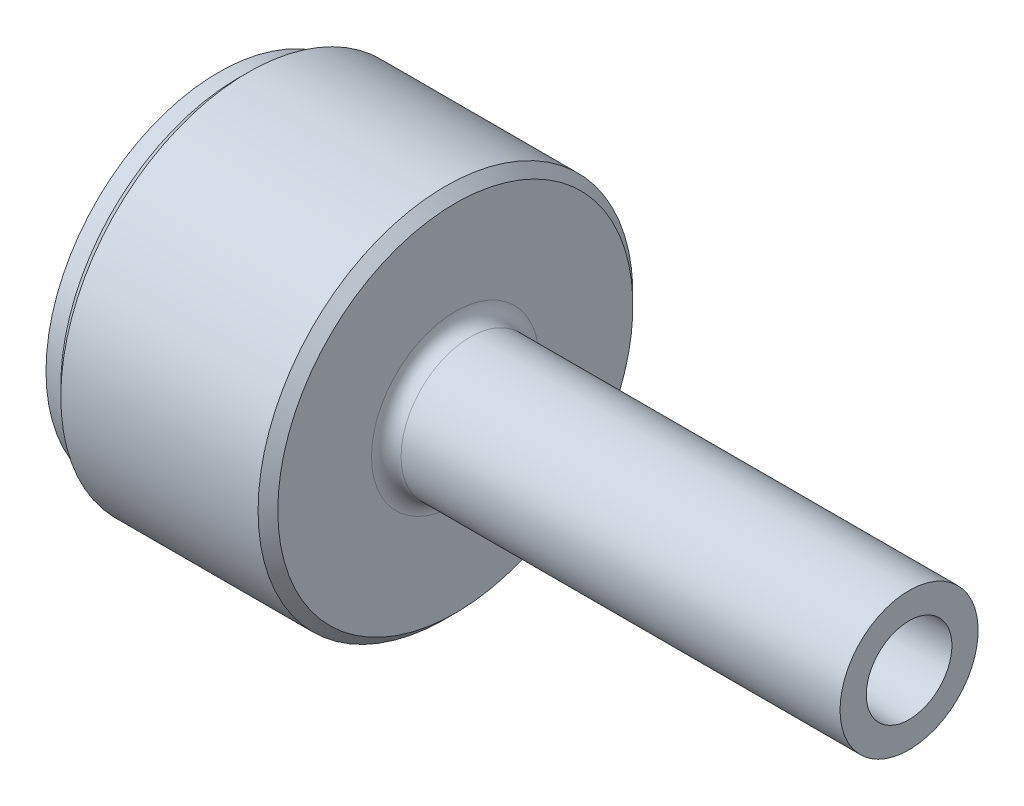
ISO-10303-21;
HEADER;
FILE_DESCRIPTION(('STEP AP214'),'2;1');
FILE_NAME('part.step','',(''),(''),'','','');
FILE_SCHEMA(('AUTOMOTIVE_DESIGN { 1 0 10303 214 1 1 1 1 }'));
ENDSEC;
DATA;
#1=APPLICATION_CONTEXT('core data for automotive mechanical design processes');
#2=APPLICATION_PROTOCOL_DEFINITION('international standard','automotive_design',2000,#1);
#3=PRODUCT_CONTEXT('',#1,'mechanical');
#4=PRODUCT('Part','Part','',(#3));
#5=PRODUCT_RELATED_PRODUCT_CATEGORY('part','',(#4));
#6=PRODUCT_DEFINITION_FORMATION('','',#4);
#7=PRODUCT_DEFINITION_CONTEXT('part definition',#1,'design');
#8=PRODUCT_DEFINITION('design','',#6,#7);
#9=PRODUCT_DEFINITION_SHAPE('','',#8);
#10=(LENGTH_UNIT() NAMED_UNIT(*) SI_UNIT(.MILLI.,.METRE.));
#11=(NAMED_UNIT(*) PLANE_ANGLE_UNIT() SI_UNIT($,.RADIAN.));
#12=(NAMED_UNIT(*) SI_UNIT($,.STERADIAN.) SOLID_ANGLE_UNIT());
#13=UNCERTAINTY_MEASURE_WITH_UNIT(LENGTH_MEASURE(1.E-05),#10,'distance_accuracy_value','');
#14=(GEOMETRIC_REPRESENTATION_CONTEXT(3) GLOBAL_UNCERTAINTY_ASSIGNED_CONTEXT((#13)) GLOBAL_UNIT_ASSIGNED_CONTEXT((#10,
#11,#12)) REPRESENTATION_CONTEXT('',''));
#15=CARTESIAN_POINT('',(0.,0.,0.));
#16=DIRECTION('',(0.,0.,1.));
#17=DIRECTION('',(1.,0.,0.));
#18=AXIS2_PLACEMENT_3D('',#15,#16,#17);
#19=CARTESIAN_POINT('',(70.,7.,0.));
#20=DIRECTION('',(-1.,0.,0.));
#21=DIRECTION('',(0.,0.,1.));
#22=AXIS2_PLACEMENT_3D('',#19,#20,#21);
#23=PLANE('',#22);
#24=CARTESIAN_POINT('',(70.,0.,0.));
#25=DIRECTION('',(-1.,0.,0.));
#26=DIRECTION('',(0.,0.,1.));
#27=AXIS2_PLACEMENT_3D('',#24,#25,#26);
#28=CIRCLE('',#27,7.);
#29=CARTESIAN_POINT('',(70.,0.,7.));
#30=VERTEX_POINT('',#29);
#31=EDGE_CURVE('E40',#30,#30,#28,.T.);
#32=ORIENTED_EDGE('',*,*,#31,.F.);
#33=EDGE_LOOP('',(#32));
#34=FACE_BOUND('',#33,.T.);
#35=CARTESIAN_POINT('',(70.,0.,0.));
#36=DIRECTION('',(-1.,0.,0.));
#37=DIRECTION('',(0.,0.,1.));
#38=AXIS2_PLACEMENT_3D('',#35,#36,#37);
#39=CIRCLE('',#38,4.33969155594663);
#40=CARTESIAN_POINT('',(70.,0.,4.33969155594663));
#41=VERTEX_POINT('',#40);
#42=EDGE_CURVE('E55',#41,#41,#39,.T.);
#43=ORIENTED_EDGE('',*,*,#42,.T.);
#44=EDGE_LOOP('',(#43));
#45=FACE_BOUND('',#44,.T.);
#46=ADVANCED_FACE('F14',(#34,#45),#23,.F.);
#47=CARTESIAN_POINT('',(0.,0.,0.));
#48=DIRECTION('',(-1.,0.,0.));
#49=DIRECTION('',(0.,0.,1.));
#50=AXIS2_PLACEMENT_3D('',#47,#48,#49);
#51=CYLINDRICAL_SURFACE('',#50,7.);
#52=CARTESIAN_POINT('',(25.5,0.,0.));
#53=DIRECTION('',(-1.,0.,0.));
#54=DIRECTION('',(0.,0.,1.));
#55=AXIS2_PLACEMENT_3D('',#52,#53,#54);
#56=CIRCLE('',#55,7.);
#57=CARTESIAN_POINT('',(25.5,0.,7.));
#58=VERTEX_POINT('',#57);
#59=EDGE_CURVE('E9',#58,#58,#56,.F.);
#60=ORIENTED_EDGE('',*,*,#59,.T.);
#61=EDGE_LOOP('',(#60));
#62=FACE_BOUND('',#61,.T.);
#63=ORIENTED_EDGE('',*,*,#31,.T.);
#64=EDGE_LOOP('',(#63));
#65=FACE_BOUND('',#64,.T.);
#66=ADVANCED_FACE('F99',(#62,#65),#51,.T.);
#67=CARTESIAN_POINT('',(24.,19.,0.));
#68=DIRECTION('',(-1.,0.,0.));
#69=DIRECTION('',(0.,0.,1.));
#70=AXIS2_PLACEMENT_3D('',#67,#68,#69);
#71=PLANE('',#70);
#72=CARTESIAN_POINT('',(24.,0.,0.));
#73=DIRECTION('',(-1.,0.,0.));
#74=DIRECTION('',(0.,0.,1.));
#75=AXIS2_PLACEMENT_3D('',#72,#73,#74);
#76=CIRCLE('',#75,8.5);
#77=CARTESIAN_POINT('',(24.,0.,8.5));
#78=VERTEX_POINT('',#77);
#79=EDGE_CURVE('E21',#78,#78,#76,.T.);
#80=ORIENTED_EDGE('',*,*,#79,.T.);
#81=EDGE_LOOP('',(#80));
#82=FACE_BOUND('',#81,.T.);
#83=CARTESIAN_POINT('',(24.,0.,0.));
#84=DIRECTION('',(-1.,0.,0.));
#85=DIRECTION('',(0.,0.,1.));
#86=AXIS2_PLACEMENT_3D('',#83,#84,#85);
#87=CIRCLE('',#86,18.);
#88=CARTESIAN_POINT('',(24.,0.,18.));
#89=VERTEX_POINT('',#88);
#90=EDGE_CURVE('E29',#89,#89,#87,.F.);
#91=ORIENTED_EDGE('',*,*,#90,.T.);
#92=EDGE_LOOP('',(#91));
#93=FACE_BOUND('',#92,.T.);
#94=ADVANCED_FACE('F95',(#82,#93),#71,.F.);
#95=CARTESIAN_POINT('',(0.,0.,0.));
#96=DIRECTION('',(-1.,0.,0.));
#97=DIRECTION('',(0.,0.,1.));
#98=AXIS2_PLACEMENT_3D('',#95,#96,#97);
#99=CYLINDRICAL_SURFACE('',#98,19.);
#100=CARTESIAN_POINT('',(23.,0.,0.));
#101=DIRECTION('',(-1.,0.,0.));
#102=DIRECTION('',(0.,0.,1.));
#103=AXIS2_PLACEMENT_3D('',#100,#101,#102);
#104=CIRCLE('',#103,19.);
#105=CARTESIAN_POINT('',(23.,0.,19.));
#106=VERTEX_POINT('',#105);
#107=EDGE_CURVE('E34',#106,#106,#104,.T.);
#108=ORIENTED_EDGE('',*,*,#107,.T.);
#109=EDGE_LOOP('',(#108));
#110=FACE_BOUND('',#109,.T.);
#111=CARTESIAN_POINT('',(3.,0.,0.));
#112=DIRECTION('',(1.,0.,0.));
#113=DIRECTION('',(0.,0.,-1.));
#114=AXIS2_PLACEMENT_3D('',#111,#112,#113);
#115=CIRCLE('',#114,19.);
#116=CARTESIAN_POINT('',(3.,0.,-19.));
#117=VERTEX_POINT('',#116);
#118=EDGE_CURVE('E37',#117,#117,#115,.T.);
#119=ORIENTED_EDGE('',*,*,#118,.T.);
#120=EDGE_LOOP('',(#119));
#121=FACE_BOUND('',#120,.T.);
#122=ADVANCED_FACE('F87',(#110,#121),#99,.T.);
#123=CARTESIAN_POINT('',(2.,17.5,0.));
#124=DIRECTION('',(1.,0.,0.));
#125=DIRECTION('',(0.,0.,-1.));
#126=AXIS2_PLACEMENT_3D('',#123,#124,#125);
#127=PLANE('',#126);
#128=CARTESIAN_POINT('',(2.,0.,0.));
#129=DIRECTION('',(1.,0.,0.));
#130=DIRECTION('',(0.,0.,-1.));
#131=AXIS2_PLACEMENT_3D('',#128,#129,#130);
#132=CIRCLE('',#131,18.);
#133=CARTESIAN_POINT('',(2.,0.,-18.));
#134=VERTEX_POINT('',#133);
#135=EDGE_CURVE('E25',#134,#134,#132,.F.);
#136=ORIENTED_EDGE('',*,*,#135,.T.);
#137=EDGE_LOOP('',(#136));
#138=FACE_BOUND('',#137,.T.);
#139=CARTESIAN_POINT('',(2.,0.,0.));
#140=DIRECTION('',(-1.,0.,0.));
#141=DIRECTION('',(0.,0.,1.));
#142=AXIS2_PLACEMENT_3D('',#139,#140,#141);
#143=CIRCLE('',#142,17.5);
#144=CARTESIAN_POINT('',(2.,0.,17.5));
#145=VERTEX_POINT('',#144);
#146=EDGE_CURVE('E43',#145,#145,#143,.T.);
#147=ORIENTED_EDGE('',*,*,#146,.F.);
#148=EDGE_LOOP('',(#147));
#149=FACE_BOUND('',#148,.T.);
#150=ADVANCED_FACE('F82',(#138,#149),#127,.F.);
#151=CARTESIAN_POINT('',(0.,0.,0.));
#152=DIRECTION('',(-1.,0.,0.));
#153=DIRECTION('',(0.,0.,1.));
#154=AXIS2_PLACEMENT_3D('',#151,#152,#153);
#155=CYLINDRICAL_SURFACE('',#154,17.5);
#156=CARTESIAN_POINT('',(0.,0.,0.));
#157=DIRECTION('',(-1.,0.,0.));
#158=DIRECTION('',(0.,0.,1.));
#159=AXIS2_PLACEMENT_3D('',#156,#157,#158);
#160=CIRCLE('',#159,17.5);
#161=CARTESIAN_POINT('',(0.,0.,17.5));
#162=VERTEX_POINT('',#161);
#163=EDGE_CURVE('E46',#162,#162,#160,.T.);
#164=ORIENTED_EDGE('',*,*,#163,.F.);
#165=EDGE_LOOP('',(#164));
#166=FACE_BOUND('',#165,.T.);
#167=ORIENTED_EDGE('',*,*,#146,.T.);
#168=EDGE_LOOP('',(#167));
#169=FACE_BOUND('',#168,.T.);
#170=ADVANCED_FACE('F76',(#166,#169),#155,.T.);
#171=CARTESIAN_POINT('',(0.,8.9624151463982,0.));
#172=DIRECTION('',(1.,0.,0.));
#173=DIRECTION('',(0.,0.,-1.));
#174=AXIS2_PLACEMENT_3D('',#171,#172,#173);
#175=PLANE('',#174);
#176=CARTESIAN_POINT('',(0.,0.,0.));
#177=DIRECTION('',(-1.,0.,0.));
#178=DIRECTION('',(0.,0.,1.));
#179=AXIS2_PLACEMENT_3D('',#176,#177,#178);
#180=CIRCLE('',#179,8.9624151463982);
#181=CARTESIAN_POINT('',(0.,0.,8.9624151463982));
#182=VERTEX_POINT('',#181);
#183=EDGE_CURVE('E49',#182,#182,#180,.T.);
#184=ORIENTED_EDGE('',*,*,#183,.F.);
#185=EDGE_LOOP('',(#184));
#186=FACE_BOUND('',#185,.T.);
#187=ORIENTED_EDGE('',*,*,#163,.T.);
#188=EDGE_LOOP('',(#187));
#189=FACE_BOUND('',#188,.T.);
#190=ADVANCED_FACE('F70',(#186,#189),#175,.F.);
#191=CARTESIAN_POINT('',(-11.8284890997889,0.,0.));
#192=DIRECTION('',(-1.,0.,0.));
#193=DIRECTION('',(0.,0.,1.));
#194=AXIS2_PLACEMENT_3D('',#191,#192,#193);
#195=DEGENERATE_TOROIDAL_SURFACE('',#194,0.261837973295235,15.,.F.);
#196=CARTESIAN_POINT('',(3.,0.,0.));
#197=DIRECTION('',(-1.,0.,0.));
#198=DIRECTION('',(0.,0.,1.));
#199=AXIS2_PLACEMENT_3D('',#196,#197,#198);
#200=CIRCLE('',#199,2.);
#201=CARTESIAN_POINT('',(3.,0.,2.));
#202=VERTEX_POINT('',#201);
#203=EDGE_CURVE('E52',#202,#202,#200,.T.);
#204=ORIENTED_EDGE('',*,*,#203,.F.);
#205=EDGE_LOOP('',(#204));
#206=FACE_BOUND('',#205,.T.);
#207=ORIENTED_EDGE('',*,*,#183,.T.);
#208=EDGE_LOOP('',(#207));
#209=FACE_BOUND('',#208,.T.);
#210=ADVANCED_FACE('F64',(#206,#209),#195,.T.);
#211=CARTESIAN_POINT('',(3.,0.,0.));
#212=DIRECTION('',(1.,0.,0.));
#213=DIRECTION('',(0.,0.,-1.));
#214=AXIS2_PLACEMENT_3D('',#211,#212,#213);
#215=CONICAL_SURFACE('',#214,2.,0.0349065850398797);
#216=ORIENTED_EDGE('',*,*,#42,.F.);
#217=EDGE_LOOP('',(#216));
#218=FACE_BOUND('',#217,.T.);
#219=ORIENTED_EDGE('',*,*,#203,.T.);
#220=EDGE_LOOP('',(#219));
#221=FACE_BOUND('',#220,.T.);
#222=ADVANCED_FACE('F60',(#218,#221),#215,.F.);
#223=CARTESIAN_POINT('',(23.,0.,0.));
#224=DIRECTION('',(-1.,0.,0.));
#225=DIRECTION('',(0.,0.,1.));
#226=AXIS2_PLACEMENT_3D('',#223,#224,#225);
#227=CONICAL_SURFACE('',#226,19.,0.78539816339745);
#228=ORIENTED_EDGE('',*,*,#90,.F.);
#229=EDGE_LOOP('',(#228));
#230=FACE_BOUND('',#229,.T.);
#231=ORIENTED_EDGE('',*,*,#107,.F.);
#232=EDGE_LOOP('',(#231));
#233=FACE_BOUND('',#232,.T.);
#234=ADVANCED_FACE('F63',(#230,#233),#227,.T.);
#235=CARTESIAN_POINT('',(2.,0.,0.));
#236=DIRECTION('',(1.,0.,0.));
#237=DIRECTION('',(0.,0.,-1.));
#238=AXIS2_PLACEMENT_3D('',#235,#236,#237);
#239=CONICAL_SURFACE('',#238,18.,0.78539816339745);
#240=ORIENTED_EDGE('',*,*,#118,.F.);
#241=EDGE_LOOP('',(#240));
#242=FACE_BOUND('',#241,.T.);
#243=ORIENTED_EDGE('',*,*,#135,.F.);
#244=EDGE_LOOP('',(#243));
#245=FACE_BOUND('',#244,.T.);
#246=ADVANCED_FACE('F111',(#242,#245),#239,.T.);
#247=CARTESIAN_POINT('',(25.5,0.,0.));
#248=DIRECTION('',(-1.,0.,0.));
#249=DIRECTION('',(0.,0.,1.));
#250=AXIS2_PLACEMENT_3D('',#247,#248,#249);
#251=TOROIDAL_SURFACE('',#250,8.5,1.5);
#252=ORIENTED_EDGE('',*,*,#59,.F.);
#253=EDGE_LOOP('',(#252));
#254=FACE_BOUND('',#253,.T.);
#255=ORIENTED_EDGE('',*,*,#79,.F.);
#256=EDGE_LOOP('',(#255));
#257=FACE_BOUND('',#256,.T.);
#258=ADVANCED_FACE('F16',(#254,#257),#251,.F.);
#259=CLOSED_SHELL('',(#46,#66,#94,#122,#150,#170,#190,#210,#222,#234,#246,#258));
#260=MANIFOLD_SOLID_BREP('B1',#259);
#261=ADVANCED_BREP_SHAPE_REPRESENTATION('',(#18,#260),#14);
#262=SHAPE_DEFINITION_REPRESENTATION(#9,#261);
ENDSEC;
END-ISO-10303-21;
